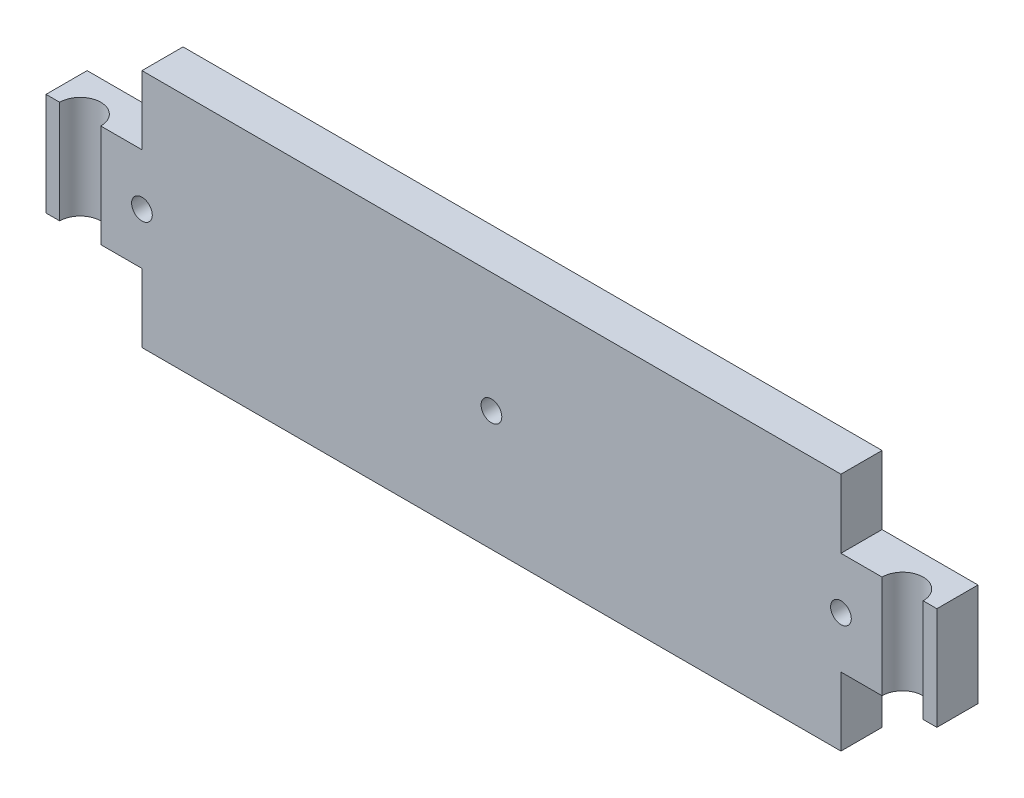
from build123d import *

# Parameters (mm, degrees)
ESQUISSE1_R             = 1.51
EXTRUSION1_DEPTH        = 6
ESQUISSE2_R             = 3
ENL_V_MAT_EXTRU_1_DEPTH = 130.94614269


with BuildPart() as part:
    # Esquisse1 → Extrusion1 (new body)
    with BuildSketch(Plane.XY):
        Polygon((-5, 25), (-5, 10), (9, 10), (9, 0), (111, 0), (111, 10), (125, 10), (125, 25), (111, 25), (111, 35), (9, 35), (9, 25), align=None)
        with Locations((9, 17.5)):
            Circle(ESQUISSE1_R, mode=Mode.SUBTRACT)
        with Locations((60, 17.5)):
            Circle(ESQUISSE1_R, mode=Mode.SUBTRACT)
        with Locations((111, 17.5)):
            Circle(ESQUISSE1_R, mode=Mode.SUBTRACT)
    extrude(amount=EXTRUSION1_DEPTH)

    # Esquisse2 → Enl_v. mat.-Extru.1 (cut, through all)
    with BuildSketch(Plane(origin=(0, 35, 0), x_dir=(-1, 0, 0), z_dir=(0, 1, 0))):
        with Locations((0, 6)):
            Circle(ESQUISSE2_R)
        with Locations((-120, 6)):
            Circle(ESQUISSE2_R)
    extrude(amount=-ENL_V_MAT_EXTRU_1_DEPTH, mode=Mode.SUBTRACT)


solid = part.part
